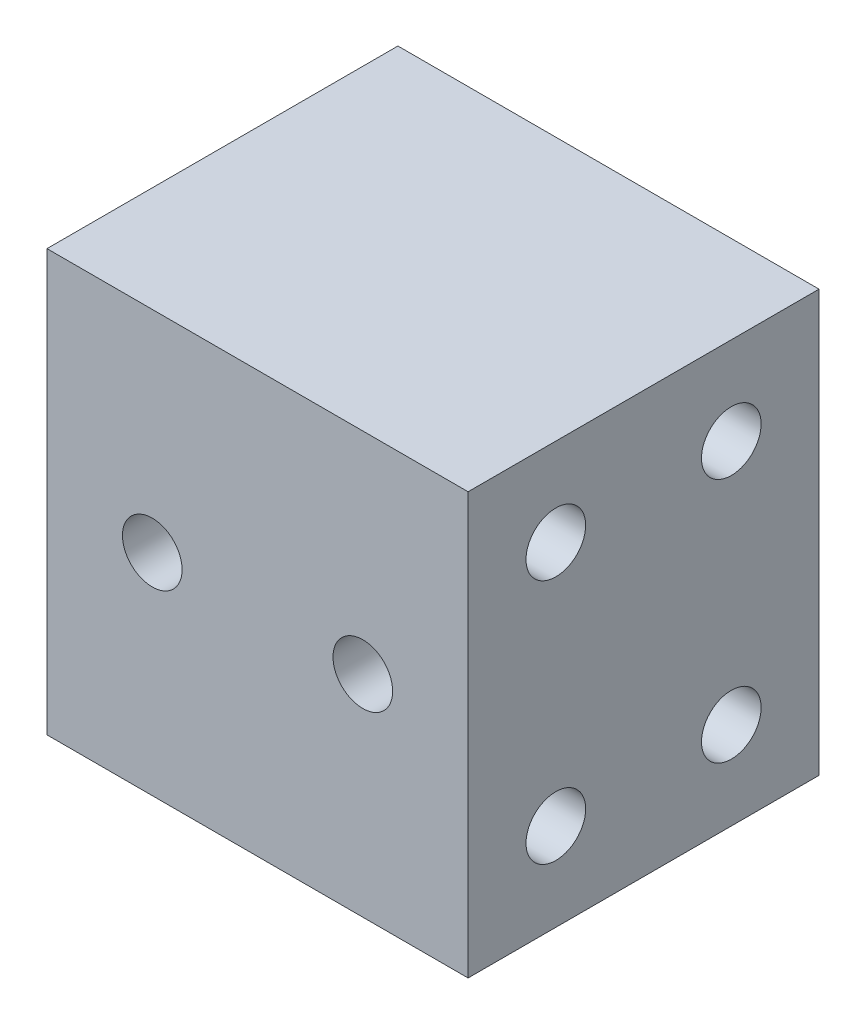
ISO-10303-21;
HEADER;
FILE_DESCRIPTION(('STEP AP214'),'2;1');
FILE_NAME('part.step','',(''),(''),'','','');
FILE_SCHEMA(('AUTOMOTIVE_DESIGN { 1 0 10303 214 1 1 1 1 }'));
ENDSEC;
DATA;
#1=APPLICATION_CONTEXT('core data for automotive mechanical design processes');
#2=APPLICATION_PROTOCOL_DEFINITION('international standard','automotive_design',2000,#1);
#3=PRODUCT_CONTEXT('',#1,'mechanical');
#4=PRODUCT('Part','Part','',(#3));
#5=PRODUCT_RELATED_PRODUCT_CATEGORY('part','',(#4));
#6=PRODUCT_DEFINITION_FORMATION('','',#4);
#7=PRODUCT_DEFINITION_CONTEXT('part definition',#1,'design');
#8=PRODUCT_DEFINITION('design','',#6,#7);
#9=PRODUCT_DEFINITION_SHAPE('','',#8);
#10=(LENGTH_UNIT() NAMED_UNIT(*) SI_UNIT(.MILLI.,.METRE.));
#11=(NAMED_UNIT(*) PLANE_ANGLE_UNIT() SI_UNIT($,.RADIAN.));
#12=(NAMED_UNIT(*) SI_UNIT($,.STERADIAN.) SOLID_ANGLE_UNIT());
#13=UNCERTAINTY_MEASURE_WITH_UNIT(LENGTH_MEASURE(1.E-05),#10,'distance_accuracy_value','');
#14=(GEOMETRIC_REPRESENTATION_CONTEXT(3) GLOBAL_UNCERTAINTY_ASSIGNED_CONTEXT((#13)) GLOBAL_UNIT_ASSIGNED_CONTEXT((#10,
#11,#12)) REPRESENTATION_CONTEXT('',''));
#15=CARTESIAN_POINT('',(0.,0.,0.));
#16=DIRECTION('',(0.,0.,1.));
#17=DIRECTION('',(1.,0.,0.));
#18=AXIS2_PLACEMENT_3D('',#15,#16,#17);
#19=CARTESIAN_POINT('',(0.,0.,20.));
#20=DIRECTION('',(0.,0.,-1.));
#21=DIRECTION('',(-1.,0.,0.));
#22=AXIS2_PLACEMENT_3D('',#19,#20,#21);
#23=PLANE('',#22);
#24=DIRECTION('',(0.,-1.,0.));
#25=VECTOR('',#24,1.);
#26=CARTESIAN_POINT('',(-12.,-12.,20.));
#27=LINE('',#26,#25);
#28=CARTESIAN_POINT('',(-12.,12.,20.));
#29=VERTEX_POINT('',#28);
#30=CARTESIAN_POINT('',(-12.,-12.,20.));
#31=VERTEX_POINT('',#30);
#32=EDGE_CURVE('E93',#29,#31,#27,.T.);
#33=ORIENTED_EDGE('',*,*,#32,.T.);
#34=DIRECTION('',(1.,0.,0.));
#35=VECTOR('',#34,1.);
#36=CARTESIAN_POINT('',(-12.,-12.,20.));
#37=LINE('',#36,#35);
#38=CARTESIAN_POINT('',(12.,-12.,20.));
#39=VERTEX_POINT('',#38);
#40=EDGE_CURVE('E88',#31,#39,#37,.T.);
#41=ORIENTED_EDGE('',*,*,#40,.T.);
#42=DIRECTION('',(0.,1.,0.));
#43=VECTOR('',#42,1.);
#44=CARTESIAN_POINT('',(12.,-12.,20.));
#45=LINE('',#44,#43);
#46=CARTESIAN_POINT('',(12.,12.,20.));
#47=VERTEX_POINT('',#46);
#48=EDGE_CURVE('E90',#39,#47,#45,.T.);
#49=ORIENTED_EDGE('',*,*,#48,.T.);
#50=DIRECTION('',(-1.,0.,0.));
#51=VECTOR('',#50,1.);
#52=CARTESIAN_POINT('',(-12.,12.,20.));
#53=LINE('',#52,#51);
#54=EDGE_CURVE('E57',#47,#29,#53,.T.);
#55=ORIENTED_EDGE('',*,*,#54,.T.);
#56=EDGE_LOOP('',(#33,#41,#49,#55));
#57=FACE_BOUND('',#56,.T.);
#58=CARTESIAN_POINT('',(-6.,0.,20.));
#59=DIRECTION('',(0.,0.,1.));
#60=DIRECTION('',(1.,0.,0.));
#61=AXIS2_PLACEMENT_3D('',#58,#59,#60);
#62=CIRCLE('',#61,1.7);
#63=CARTESIAN_POINT('',(-4.3,0.,20.));
#64=VERTEX_POINT('',#63);
#65=EDGE_CURVE('E106',#64,#64,#62,.T.);
#66=ORIENTED_EDGE('',*,*,#65,.F.);
#67=EDGE_LOOP('',(#66));
#68=FACE_BOUND('',#67,.T.);
#69=CARTESIAN_POINT('',(6.,0.,20.));
#70=DIRECTION('',(0.,0.,1.));
#71=DIRECTION('',(1.,0.,0.));
#72=AXIS2_PLACEMENT_3D('',#69,#70,#71);
#73=CIRCLE('',#72,1.7);
#74=CARTESIAN_POINT('',(7.7,0.,20.));
#75=VERTEX_POINT('',#74);
#76=EDGE_CURVE('E122',#75,#75,#73,.T.);
#77=ORIENTED_EDGE('',*,*,#76,.F.);
#78=EDGE_LOOP('',(#77));
#79=FACE_BOUND('',#78,.T.);
#80=ADVANCED_FACE('F39',(#57,#68,#79),#23,.F.);
#81=CARTESIAN_POINT('',(0.,0.,0.));
#82=DIRECTION('',(0.,0.,-1.));
#83=DIRECTION('',(-1.,0.,0.));
#84=AXIS2_PLACEMENT_3D('',#81,#82,#83);
#85=PLANE('',#84);
#86=CARTESIAN_POINT('',(-6.,0.,0.));
#87=DIRECTION('',(0.,0.,1.));
#88=DIRECTION('',(1.,0.,0.));
#89=AXIS2_PLACEMENT_3D('',#86,#87,#88);
#90=CIRCLE('',#89,1.7);
#91=CARTESIAN_POINT('',(-4.3,0.,0.));
#92=VERTEX_POINT('',#91);
#93=EDGE_CURVE('E117',#92,#92,#90,.T.);
#94=ORIENTED_EDGE('',*,*,#93,.T.);
#95=EDGE_LOOP('',(#94));
#96=FACE_BOUND('',#95,.T.);
#97=DIRECTION('',(0.,-1.,0.));
#98=VECTOR('',#97,1.);
#99=CARTESIAN_POINT('',(-12.,-12.,0.));
#100=LINE('',#99,#98);
#101=CARTESIAN_POINT('',(-12.,12.,0.));
#102=VERTEX_POINT('',#101);
#103=CARTESIAN_POINT('',(-12.,-12.,0.));
#104=VERTEX_POINT('',#103);
#105=EDGE_CURVE('E103',#102,#104,#100,.T.);
#106=ORIENTED_EDGE('',*,*,#105,.F.);
#107=DIRECTION('',(-1.,0.,0.));
#108=VECTOR('',#107,1.);
#109=CARTESIAN_POINT('',(-12.,12.,0.));
#110=LINE('',#109,#108);
#111=CARTESIAN_POINT('',(12.,12.,0.));
#112=VERTEX_POINT('',#111);
#113=EDGE_CURVE('E80',#112,#102,#110,.T.);
#114=ORIENTED_EDGE('',*,*,#113,.F.);
#115=DIRECTION('',(0.,1.,0.));
#116=VECTOR('',#115,1.);
#117=CARTESIAN_POINT('',(12.,-12.,0.));
#118=LINE('',#117,#116);
#119=CARTESIAN_POINT('',(12.,-12.,0.));
#120=VERTEX_POINT('',#119);
#121=EDGE_CURVE('E71',#120,#112,#118,.T.);
#122=ORIENTED_EDGE('',*,*,#121,.F.);
#123=DIRECTION('',(1.,0.,0.));
#124=VECTOR('',#123,1.);
#125=CARTESIAN_POINT('',(-12.,-12.,0.));
#126=LINE('',#125,#124);
#127=EDGE_CURVE('E92',#104,#120,#126,.T.);
#128=ORIENTED_EDGE('',*,*,#127,.F.);
#129=EDGE_LOOP('',(#106,#114,#122,#128));
#130=FACE_BOUND('',#129,.T.);
#131=CARTESIAN_POINT('',(6.,0.,0.));
#132=DIRECTION('',(0.,0.,1.));
#133=DIRECTION('',(1.,0.,0.));
#134=AXIS2_PLACEMENT_3D('',#131,#132,#133);
#135=CIRCLE('',#134,1.7);
#136=CARTESIAN_POINT('',(7.7,0.,0.));
#137=VERTEX_POINT('',#136);
#138=EDGE_CURVE('E121',#137,#137,#135,.T.);
#139=ORIENTED_EDGE('',*,*,#138,.T.);
#140=EDGE_LOOP('',(#139));
#141=FACE_BOUND('',#140,.T.);
#142=ADVANCED_FACE('F111',(#96,#130,#141),#85,.T.);
#143=CARTESIAN_POINT('',(-12.,-12.,20.));
#144=DIRECTION('',(1.,0.,0.));
#145=DIRECTION('',(0.,0.,-1.));
#146=AXIS2_PLACEMENT_3D('',#143,#144,#145);
#147=PLANE('',#146);
#148=CARTESIAN_POINT('',(-12.,-7.,15.));
#149=DIRECTION('',(1.,0.,0.));
#150=DIRECTION('',(0.,0.,-1.));
#151=AXIS2_PLACEMENT_3D('',#148,#149,#150);
#152=CIRCLE('',#151,1.7);
#153=CARTESIAN_POINT('',(-12.,-7.,13.3));
#154=VERTEX_POINT('',#153);
#155=EDGE_CURVE('E136',#154,#154,#152,.T.);
#156=ORIENTED_EDGE('',*,*,#155,.T.);
#157=EDGE_LOOP('',(#156));
#158=FACE_BOUND('',#157,.T.);
#159=CARTESIAN_POINT('',(-12.,7.,5.));
#160=DIRECTION('',(1.,0.,0.));
#161=DIRECTION('',(0.,0.,-1.));
#162=AXIS2_PLACEMENT_3D('',#159,#160,#161);
#163=CIRCLE('',#162,1.7);
#164=CARTESIAN_POINT('',(-12.,7.,3.3));
#165=VERTEX_POINT('',#164);
#166=EDGE_CURVE('E138',#165,#165,#163,.T.);
#167=ORIENTED_EDGE('',*,*,#166,.T.);
#168=EDGE_LOOP('',(#167));
#169=FACE_BOUND('',#168,.T.);
#170=CARTESIAN_POINT('',(-12.,7.,15.));
#171=DIRECTION('',(1.,0.,0.));
#172=DIRECTION('',(0.,0.,-1.));
#173=AXIS2_PLACEMENT_3D('',#170,#171,#172);
#174=CIRCLE('',#173,1.7);
#175=CARTESIAN_POINT('',(-12.,7.,13.3));
#176=VERTEX_POINT('',#175);
#177=EDGE_CURVE('E147',#176,#176,#174,.T.);
#178=ORIENTED_EDGE('',*,*,#177,.T.);
#179=EDGE_LOOP('',(#178));
#180=FACE_BOUND('',#179,.T.);
#181=CARTESIAN_POINT('',(-12.,-7.,5.));
#182=DIRECTION('',(1.,0.,0.));
#183=DIRECTION('',(0.,0.,-1.));
#184=AXIS2_PLACEMENT_3D('',#181,#182,#183);
#185=CIRCLE('',#184,1.7);
#186=CARTESIAN_POINT('',(-12.,-7.,3.3));
#187=VERTEX_POINT('',#186);
#188=EDGE_CURVE('E130',#187,#187,#185,.T.);
#189=ORIENTED_EDGE('',*,*,#188,.T.);
#190=EDGE_LOOP('',(#189));
#191=FACE_BOUND('',#190,.T.);
#192=ORIENTED_EDGE('',*,*,#105,.T.);
#193=DIRECTION('',(0.,0.,-1.));
#194=VECTOR('',#193,1.);
#195=CARTESIAN_POINT('',(-12.,-12.,20.));
#196=LINE('',#195,#194);
#197=EDGE_CURVE('E11',#31,#104,#196,.T.);
#198=ORIENTED_EDGE('',*,*,#197,.F.);
#199=ORIENTED_EDGE('',*,*,#32,.F.);
#200=DIRECTION('',(0.,0.,-1.));
#201=VECTOR('',#200,1.);
#202=CARTESIAN_POINT('',(-12.,12.,20.));
#203=LINE('',#202,#201);
#204=EDGE_CURVE('E97',#29,#102,#203,.T.);
#205=ORIENTED_EDGE('',*,*,#204,.T.);
#206=EDGE_LOOP('',(#192,#198,#199,#205));
#207=FACE_BOUND('',#206,.T.);
#208=ADVANCED_FACE('F41',(#158,#169,#180,#191,#207),#147,.F.);
#209=CARTESIAN_POINT('',(-12.,-12.,20.));
#210=DIRECTION('',(0.,1.,0.));
#211=DIRECTION('',(0.,0.,1.));
#212=AXIS2_PLACEMENT_3D('',#209,#210,#211);
#213=PLANE('',#212);
#214=ORIENTED_EDGE('',*,*,#127,.T.);
#215=DIRECTION('',(0.,0.,-1.));
#216=VECTOR('',#215,1.);
#217=CARTESIAN_POINT('',(12.,-12.,20.));
#218=LINE('',#217,#216);
#219=EDGE_CURVE('E48',#39,#120,#218,.T.);
#220=ORIENTED_EDGE('',*,*,#219,.F.);
#221=ORIENTED_EDGE('',*,*,#40,.F.);
#222=ORIENTED_EDGE('',*,*,#197,.T.);
#223=EDGE_LOOP('',(#214,#220,#221,#222));
#224=FACE_BOUND('',#223,.T.);
#225=ADVANCED_FACE('F94',(#224),#213,.F.);
#226=CARTESIAN_POINT('',(12.,-12.,20.));
#227=DIRECTION('',(-1.,0.,0.));
#228=DIRECTION('',(0.,0.,1.));
#229=AXIS2_PLACEMENT_3D('',#226,#227,#228);
#230=PLANE('',#229);
#231=CARTESIAN_POINT('',(12.,-7.,15.));
#232=DIRECTION('',(1.,0.,0.));
#233=DIRECTION('',(0.,0.,-1.));
#234=AXIS2_PLACEMENT_3D('',#231,#232,#233);
#235=CIRCLE('',#234,1.7);
#236=CARTESIAN_POINT('',(12.,-7.,13.3));
#237=VERTEX_POINT('',#236);
#238=EDGE_CURVE('E131',#237,#237,#235,.T.);
#239=ORIENTED_EDGE('',*,*,#238,.F.);
#240=EDGE_LOOP('',(#239));
#241=FACE_BOUND('',#240,.T.);
#242=CARTESIAN_POINT('',(12.,7.,5.));
#243=DIRECTION('',(1.,0.,0.));
#244=DIRECTION('',(0.,0.,-1.));
#245=AXIS2_PLACEMENT_3D('',#242,#243,#244);
#246=CIRCLE('',#245,1.7);
#247=CARTESIAN_POINT('',(12.,7.,3.3));
#248=VERTEX_POINT('',#247);
#249=EDGE_CURVE('E137',#248,#248,#246,.T.);
#250=ORIENTED_EDGE('',*,*,#249,.F.);
#251=EDGE_LOOP('',(#250));
#252=FACE_BOUND('',#251,.T.);
#253=CARTESIAN_POINT('',(12.,7.,15.));
#254=DIRECTION('',(1.,0.,0.));
#255=DIRECTION('',(0.,0.,-1.));
#256=AXIS2_PLACEMENT_3D('',#253,#254,#255);
#257=CIRCLE('',#256,1.7);
#258=CARTESIAN_POINT('',(12.,7.,13.3));
#259=VERTEX_POINT('',#258);
#260=EDGE_CURVE('E141',#259,#259,#257,.T.);
#261=ORIENTED_EDGE('',*,*,#260,.F.);
#262=EDGE_LOOP('',(#261));
#263=FACE_BOUND('',#262,.T.);
#264=CARTESIAN_POINT('',(12.,-7.,5.));
#265=DIRECTION('',(1.,0.,0.));
#266=DIRECTION('',(0.,0.,-1.));
#267=AXIS2_PLACEMENT_3D('',#264,#265,#266);
#268=CIRCLE('',#267,1.7);
#269=CARTESIAN_POINT('',(12.,-7.,3.3));
#270=VERTEX_POINT('',#269);
#271=EDGE_CURVE('E134',#270,#270,#268,.T.);
#272=ORIENTED_EDGE('',*,*,#271,.F.);
#273=EDGE_LOOP('',(#272));
#274=FACE_BOUND('',#273,.T.);
#275=ORIENTED_EDGE('',*,*,#121,.T.);
#276=DIRECTION('',(0.,0.,-1.));
#277=VECTOR('',#276,1.);
#278=CARTESIAN_POINT('',(12.,12.,20.));
#279=LINE('',#278,#277);
#280=EDGE_CURVE('E96',#47,#112,#279,.T.);
#281=ORIENTED_EDGE('',*,*,#280,.F.);
#282=ORIENTED_EDGE('',*,*,#48,.F.);
#283=ORIENTED_EDGE('',*,*,#219,.T.);
#284=EDGE_LOOP('',(#275,#281,#282,#283));
#285=FACE_BOUND('',#284,.T.);
#286=ADVANCED_FACE('F100',(#241,#252,#263,#274,#285),#230,.F.);
#287=CARTESIAN_POINT('',(-12.,12.,20.));
#288=DIRECTION('',(0.,-1.,0.));
#289=DIRECTION('',(0.,0.,-1.));
#290=AXIS2_PLACEMENT_3D('',#287,#288,#289);
#291=PLANE('',#290);
#292=ORIENTED_EDGE('',*,*,#113,.T.);
#293=ORIENTED_EDGE('',*,*,#204,.F.);
#294=ORIENTED_EDGE('',*,*,#54,.F.);
#295=ORIENTED_EDGE('',*,*,#280,.T.);
#296=EDGE_LOOP('',(#292,#293,#294,#295));
#297=FACE_BOUND('',#296,.T.);
#298=ADVANCED_FACE('F112',(#297),#291,.F.);
#299=CARTESIAN_POINT('',(-6.,0.,20.));
#300=DIRECTION('',(0.,0.,-1.));
#301=DIRECTION('',(-1.,0.,0.));
#302=AXIS2_PLACEMENT_3D('',#299,#300,#301);
#303=CYLINDRICAL_SURFACE('',#302,1.7);
#304=ORIENTED_EDGE('',*,*,#65,.T.);
#305=EDGE_LOOP('',(#304));
#306=FACE_BOUND('',#305,.T.);
#307=ORIENTED_EDGE('',*,*,#93,.F.);
#308=EDGE_LOOP('',(#307));
#309=FACE_BOUND('',#308,.T.);
#310=ADVANCED_FACE('F180',(#306,#309),#303,.F.);
#311=CARTESIAN_POINT('',(6.,0.,20.));
#312=DIRECTION('',(0.,0.,-1.));
#313=DIRECTION('',(-1.,0.,0.));
#314=AXIS2_PLACEMENT_3D('',#311,#312,#313);
#315=CYLINDRICAL_SURFACE('',#314,1.7);
#316=ORIENTED_EDGE('',*,*,#76,.T.);
#317=EDGE_LOOP('',(#316));
#318=FACE_BOUND('',#317,.T.);
#319=ORIENTED_EDGE('',*,*,#138,.F.);
#320=EDGE_LOOP('',(#319));
#321=FACE_BOUND('',#320,.T.);
#322=ADVANCED_FACE('F173',(#318,#321),#315,.F.);
#323=CARTESIAN_POINT('',(-12.,-7.,5.));
#324=DIRECTION('',(1.,0.,0.));
#325=DIRECTION('',(0.,0.,-1.));
#326=AXIS2_PLACEMENT_3D('',#323,#324,#325);
#327=CYLINDRICAL_SURFACE('',#326,1.7);
#328=ORIENTED_EDGE('',*,*,#188,.F.);
#329=EDGE_LOOP('',(#328));
#330=FACE_BOUND('',#329,.T.);
#331=ORIENTED_EDGE('',*,*,#271,.T.);
#332=EDGE_LOOP('',(#331));
#333=FACE_BOUND('',#332,.T.);
#334=ADVANCED_FACE('F159',(#330,#333),#327,.F.);
#335=CARTESIAN_POINT('',(-12.,7.,15.));
#336=DIRECTION('',(1.,0.,0.));
#337=DIRECTION('',(0.,0.,-1.));
#338=AXIS2_PLACEMENT_3D('',#335,#336,#337);
#339=CYLINDRICAL_SURFACE('',#338,1.7);
#340=ORIENTED_EDGE('',*,*,#177,.F.);
#341=EDGE_LOOP('',(#340));
#342=FACE_BOUND('',#341,.T.);
#343=ORIENTED_EDGE('',*,*,#260,.T.);
#344=EDGE_LOOP('',(#343));
#345=FACE_BOUND('',#344,.T.);
#346=ADVANCED_FACE('F156',(#342,#345),#339,.F.);
#347=CARTESIAN_POINT('',(-12.,7.,5.));
#348=DIRECTION('',(1.,0.,0.));
#349=DIRECTION('',(0.,0.,-1.));
#350=AXIS2_PLACEMENT_3D('',#347,#348,#349);
#351=CYLINDRICAL_SURFACE('',#350,1.7);
#352=ORIENTED_EDGE('',*,*,#166,.F.);
#353=EDGE_LOOP('',(#352));
#354=FACE_BOUND('',#353,.T.);
#355=ORIENTED_EDGE('',*,*,#249,.T.);
#356=EDGE_LOOP('',(#355));
#357=FACE_BOUND('',#356,.T.);
#358=ADVANCED_FACE('F157',(#354,#357),#351,.F.);
#359=CARTESIAN_POINT('',(-12.,-7.,15.));
#360=DIRECTION('',(1.,0.,0.));
#361=DIRECTION('',(0.,0.,-1.));
#362=AXIS2_PLACEMENT_3D('',#359,#360,#361);
#363=CYLINDRICAL_SURFACE('',#362,1.7);
#364=ORIENTED_EDGE('',*,*,#155,.F.);
#365=EDGE_LOOP('',(#364));
#366=FACE_BOUND('',#365,.T.);
#367=ORIENTED_EDGE('',*,*,#238,.T.);
#368=EDGE_LOOP('',(#367));
#369=FACE_BOUND('',#368,.T.);
#370=ADVANCED_FACE('F202',(#366,#369),#363,.F.);
#371=CLOSED_SHELL('',(#80,#142,#208,#225,#286,#298,#310,#322,#334,#346,#358,#370));
#372=MANIFOLD_SOLID_BREP('B2',#371);
#373=ADVANCED_BREP_SHAPE_REPRESENTATION('',(#18,#372),#14);
#374=SHAPE_DEFINITION_REPRESENTATION(#9,#373);
ENDSEC;
END-ISO-10303-21;
